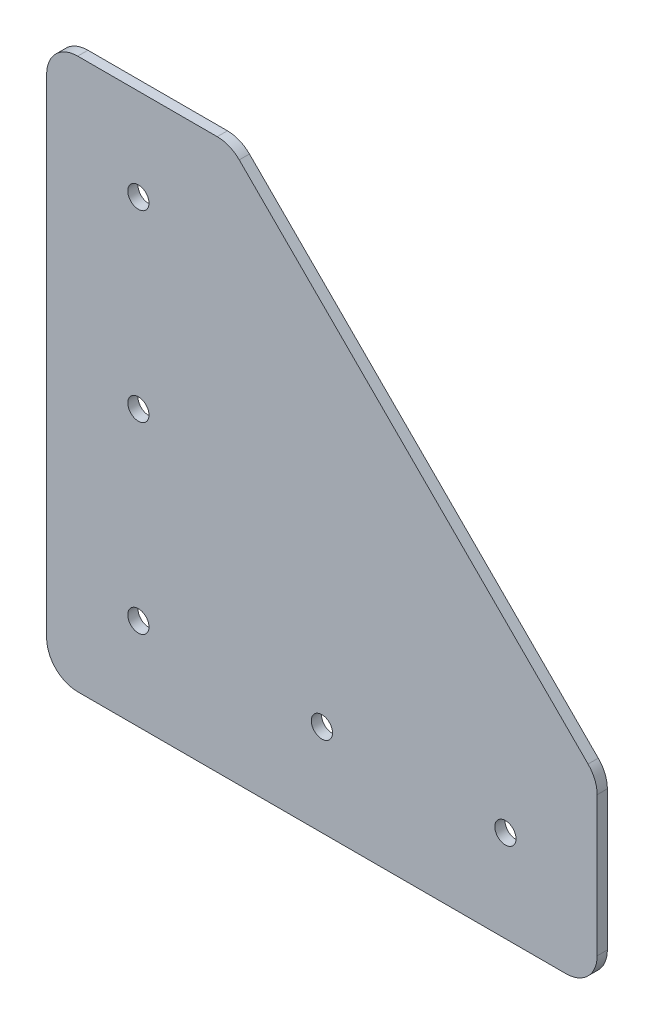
ISO-10303-21;
HEADER;
FILE_DESCRIPTION(('STEP AP214'),'2;1');
FILE_NAME('part.step','',(''),(''),'','','');
FILE_SCHEMA(('AUTOMOTIVE_DESIGN { 1 0 10303 214 1 1 1 1 }'));
ENDSEC;
DATA;
#1=APPLICATION_CONTEXT('core data for automotive mechanical design processes');
#2=APPLICATION_PROTOCOL_DEFINITION('international standard','automotive_design',2000,#1);
#3=PRODUCT_CONTEXT('',#1,'mechanical');
#4=PRODUCT('Part','Part','',(#3));
#5=PRODUCT_RELATED_PRODUCT_CATEGORY('part','',(#4));
#6=PRODUCT_DEFINITION_FORMATION('','',#4);
#7=PRODUCT_DEFINITION_CONTEXT('part definition',#1,'design');
#8=PRODUCT_DEFINITION('design','',#6,#7);
#9=PRODUCT_DEFINITION_SHAPE('','',#8);
#10=(LENGTH_UNIT() NAMED_UNIT(*) SI_UNIT(.MILLI.,.METRE.));
#11=(NAMED_UNIT(*) PLANE_ANGLE_UNIT() SI_UNIT($,.RADIAN.));
#12=(NAMED_UNIT(*) SI_UNIT($,.STERADIAN.) SOLID_ANGLE_UNIT());
#13=UNCERTAINTY_MEASURE_WITH_UNIT(LENGTH_MEASURE(1.E-05),#10,'distance_accuracy_value','');
#14=(GEOMETRIC_REPRESENTATION_CONTEXT(3) GLOBAL_UNCERTAINTY_ASSIGNED_CONTEXT((#13)) GLOBAL_UNIT_ASSIGNED_CONTEXT((#10,
#11,#12)) REPRESENTATION_CONTEXT('',''));
#15=CARTESIAN_POINT('',(0.,0.,0.));
#16=DIRECTION('',(0.,0.,1.));
#17=DIRECTION('',(1.,0.,0.));
#18=AXIS2_PLACEMENT_3D('',#15,#16,#17);
#19=CARTESIAN_POINT('',(0.,4.841875,0.));
#20=DIRECTION('',(1.,0.,0.));
#21=DIRECTION('',(0.,1.,0.));
#22=AXIS2_PLACEMENT_3D('',#19,#20,#21);
#23=PLANE('',#22);
#24=DIRECTION('',(0.,0.,-1.));
#25=VECTOR('',#24,1.);
#26=CARTESIAN_POINT('',(0.,4.84187499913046,0.79375));
#27=LINE('',#26,#25);
#28=CARTESIAN_POINT('',(0.,4.84187499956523,0.));
#29=VERTEX_POINT('',#28);
#30=CARTESIAN_POINT('',(0.,4.84187499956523,1.5875));
#31=VERTEX_POINT('',#30);
#32=EDGE_CURVE('E141',#29,#31,#27,.F.);
#33=ORIENTED_EDGE('',*,*,#32,.T.);
#34=DIRECTION('',(0.,-1.,0.));
#35=VECTOR('',#34,1.);
#36=CARTESIAN_POINT('',(0.,42.8625,1.5875));
#37=LINE('',#36,#35);
#38=CARTESIAN_POINT('',(0.,80.883125,1.5875));
#39=VERTEX_POINT('',#38);
#40=EDGE_CURVE('E171',#39,#31,#37,.T.);
#41=ORIENTED_EDGE('',*,*,#40,.F.);
#42=DIRECTION('',(0.,0.,1.));
#43=VECTOR('',#42,1.);
#44=CARTESIAN_POINT('',(0.,80.883125,0.79375));
#45=LINE('',#44,#43);
#46=CARTESIAN_POINT('',(0.,80.883125,0.));
#47=VERTEX_POINT('',#46);
#48=EDGE_CURVE('E119',#39,#47,#45,.F.);
#49=ORIENTED_EDGE('',*,*,#48,.T.);
#50=DIRECTION('',(0.,-1.,0.));
#51=VECTOR('',#50,1.);
#52=CARTESIAN_POINT('',(0.,42.8625,0.));
#53=LINE('',#52,#51);
#54=EDGE_CURVE('E188',#47,#29,#53,.T.);
#55=ORIENTED_EDGE('',*,*,#54,.T.);
#56=EDGE_LOOP('',(#33,#41,#49,#55));
#57=FACE_BOUND('',#56,.T.);
#58=ADVANCED_FACE('F16',(#57),#23,.F.);
#59=CARTESIAN_POINT('',(4.841875,4.841875,1.5875));
#60=DIRECTION('',(0.,0.,-1.));
#61=DIRECTION('',(0.,1.,0.));
#62=AXIS2_PLACEMENT_3D('',#59,#60,#61);
#63=CYLINDRICAL_SURFACE('',#62,4.841875);
#64=ORIENTED_EDGE('',*,*,#32,.F.);
#65=CARTESIAN_POINT('',(4.841875,4.841875,0.));
#66=DIRECTION('',(0.,0.,-1.));
#67=DIRECTION('',(0.,1.,0.));
#68=AXIS2_PLACEMENT_3D('',#65,#66,#67);
#69=CIRCLE('',#68,4.841875);
#70=CARTESIAN_POINT('',(4.841875,0.,0.));
#71=VERTEX_POINT('',#70);
#72=EDGE_CURVE('E185',#29,#71,#69,.F.);
#73=ORIENTED_EDGE('',*,*,#72,.T.);
#74=DIRECTION('',(0.,0.,1.));
#75=VECTOR('',#74,1.);
#76=CARTESIAN_POINT('',(4.841875,0.,0.79375));
#77=LINE('',#76,#75);
#78=CARTESIAN_POINT('',(4.841875,0.,1.5875));
#79=VERTEX_POINT('',#78);
#80=EDGE_CURVE('E138',#71,#79,#77,.T.);
#81=ORIENTED_EDGE('',*,*,#80,.T.);
#82=CARTESIAN_POINT('',(4.841875,4.841875,1.5875));
#83=DIRECTION('',(0.,0.,-1.));
#84=DIRECTION('',(0.,1.,0.));
#85=AXIS2_PLACEMENT_3D('',#82,#83,#84);
#86=CIRCLE('',#85,4.841875);
#87=EDGE_CURVE('E169',#31,#79,#86,.F.);
#88=ORIENTED_EDGE('',*,*,#87,.F.);
#89=EDGE_LOOP('',(#64,#73,#81,#88));
#90=FACE_BOUND('',#89,.T.);
#91=ADVANCED_FACE('F263',(#90),#63,.T.);
#92=CARTESIAN_POINT('',(80.883125,0.,0.));
#93=DIRECTION('',(0.,1.,0.));
#94=DIRECTION('',(-1.,0.,0.));
#95=AXIS2_PLACEMENT_3D('',#92,#93,#94);
#96=PLANE('',#95);
#97=ORIENTED_EDGE('',*,*,#80,.F.);
#98=DIRECTION('',(1.,0.,0.));
#99=VECTOR('',#98,1.);
#100=CARTESIAN_POINT('',(42.8625,0.,0.));
#101=LINE('',#100,#99);
#102=CARTESIAN_POINT('',(80.8831250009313,0.,0.));
#103=VERTEX_POINT('',#102);
#104=EDGE_CURVE('E184',#71,#103,#101,.T.);
#105=ORIENTED_EDGE('',*,*,#104,.T.);
#106=DIRECTION('',(0.,0.,-1.));
#107=VECTOR('',#106,1.);
#108=CARTESIAN_POINT('',(80.8831250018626,0.,0.79375));
#109=LINE('',#108,#107);
#110=CARTESIAN_POINT('',(80.8831250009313,0.,1.5875));
#111=VERTEX_POINT('',#110);
#112=EDGE_CURVE('E92',#103,#111,#109,.F.);
#113=ORIENTED_EDGE('',*,*,#112,.T.);
#114=DIRECTION('',(1.,0.,0.));
#115=VECTOR('',#114,1.);
#116=CARTESIAN_POINT('',(42.8625,0.,1.5875));
#117=LINE('',#116,#115);
#118=EDGE_CURVE('E168',#79,#111,#117,.T.);
#119=ORIENTED_EDGE('',*,*,#118,.F.);
#120=EDGE_LOOP('',(#97,#105,#113,#119));
#121=FACE_BOUND('',#120,.T.);
#122=ADVANCED_FACE('F262',(#121),#96,.F.);
#123=CARTESIAN_POINT('',(80.883125,4.841875,1.5875));
#124=DIRECTION('',(0.,0.,-1.));
#125=DIRECTION('',(0.,1.,0.));
#126=AXIS2_PLACEMENT_3D('',#123,#124,#125);
#127=CYLINDRICAL_SURFACE('',#126,4.84187500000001);
#128=ORIENTED_EDGE('',*,*,#112,.F.);
#129=CARTESIAN_POINT('',(80.883125,4.841875,0.));
#130=DIRECTION('',(0.,0.,-1.));
#131=DIRECTION('',(0.,1.,0.));
#132=AXIS2_PLACEMENT_3D('',#129,#130,#131);
#133=CIRCLE('',#132,4.84187500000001);
#134=CARTESIAN_POINT('',(85.725,4.841875,0.));
#135=VERTEX_POINT('',#134);
#136=EDGE_CURVE('E20',#103,#135,#133,.F.);
#137=ORIENTED_EDGE('',*,*,#136,.T.);
#138=DIRECTION('',(0.,0.,1.));
#139=VECTOR('',#138,1.);
#140=CARTESIAN_POINT('',(85.725,4.841875,0.79375));
#141=LINE('',#140,#139);
#142=CARTESIAN_POINT('',(85.725,4.841875,1.5875));
#143=VERTEX_POINT('',#142);
#144=EDGE_CURVE('E99',#135,#143,#141,.T.);
#145=ORIENTED_EDGE('',*,*,#144,.T.);
#146=CARTESIAN_POINT('',(80.883125,4.841875,1.5875));
#147=DIRECTION('',(0.,0.,-1.));
#148=DIRECTION('',(0.,1.,0.));
#149=AXIS2_PLACEMENT_3D('',#146,#147,#148);
#150=CIRCLE('',#149,4.84187500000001);
#151=EDGE_CURVE('E166',#111,#143,#150,.F.);
#152=ORIENTED_EDGE('',*,*,#151,.F.);
#153=EDGE_LOOP('',(#128,#137,#145,#152));
#154=FACE_BOUND('',#153,.T.);
#155=ADVANCED_FACE('F117',(#154),#127,.T.);
#156=CARTESIAN_POINT('',(85.725,4.841875,0.));
#157=DIRECTION('',(-1.,0.,0.));
#158=DIRECTION('',(0.,0.,1.));
#159=AXIS2_PLACEMENT_3D('',#156,#157,#158);
#160=PLANE('',#159);
#161=ORIENTED_EDGE('',*,*,#144,.F.);
#162=DIRECTION('',(0.,1.,0.));
#163=VECTOR('',#162,1.);
#164=CARTESIAN_POINT('',(85.725,42.8625,0.));
#165=LINE('',#164,#163);
#166=CARTESIAN_POINT('',(85.725,26.5694297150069,0.));
#167=VERTEX_POINT('',#166);
#168=EDGE_CURVE('E103',#135,#167,#165,.T.);
#169=ORIENTED_EDGE('',*,*,#168,.T.);
#170=DIRECTION('',(0.,0.,-1.));
#171=VECTOR('',#170,1.);
#172=CARTESIAN_POINT('',(85.725,26.5694297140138,0.79375));
#173=LINE('',#172,#171);
#174=CARTESIAN_POINT('',(85.725,26.5694297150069,1.5875));
#175=VERTEX_POINT('',#174);
#176=EDGE_CURVE('E105',#167,#175,#173,.F.);
#177=ORIENTED_EDGE('',*,*,#176,.T.);
#178=DIRECTION('',(0.,1.,0.));
#179=VECTOR('',#178,1.);
#180=CARTESIAN_POINT('',(85.725,42.8625,1.5875));
#181=LINE('',#180,#179);
#182=EDGE_CURVE('E104',#143,#175,#181,.T.);
#183=ORIENTED_EDGE('',*,*,#182,.F.);
#184=EDGE_LOOP('',(#161,#169,#177,#183));
#185=FACE_BOUND('',#184,.T.);
#186=ADVANCED_FACE('F101',(#185),#160,.F.);
#187=CARTESIAN_POINT('',(80.883125,26.569429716,1.5875));
#188=DIRECTION('',(0.,0.,-1.));
#189=DIRECTION('',(0.,1.,0.));
#190=AXIS2_PLACEMENT_3D('',#187,#188,#189);
#191=CYLINDRICAL_SURFACE('',#190,4.84187500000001);
#192=ORIENTED_EDGE('',*,*,#176,.F.);
#193=CARTESIAN_POINT('',(80.883125,26.569429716,0.));
#194=DIRECTION('',(0.,0.,-1.));
#195=DIRECTION('',(0.,1.,0.));
#196=AXIS2_PLACEMENT_3D('',#193,#194,#195);
#197=CIRCLE('',#196,4.84187500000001);
#198=CARTESIAN_POINT('',(84.306847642,29.993152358,0.));
#199=VERTEX_POINT('',#198);
#200=EDGE_CURVE('E115',#167,#199,#197,.F.);
#201=ORIENTED_EDGE('',*,*,#200,.T.);
#202=DIRECTION('',(0.,0.,1.));
#203=VECTOR('',#202,1.);
#204=CARTESIAN_POINT('',(84.306847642,29.993152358,0.79375));
#205=LINE('',#204,#203);
#206=CARTESIAN_POINT('',(84.3068476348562,29.9931523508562,1.5875));
#207=VERTEX_POINT('',#206);
#208=EDGE_CURVE('E133',#199,#207,#205,.T.);
#209=ORIENTED_EDGE('',*,*,#208,.T.);
#210=CARTESIAN_POINT('',(80.883125,26.569429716,1.5875));
#211=DIRECTION('',(0.,0.,-1.));
#212=DIRECTION('',(0.,1.,0.));
#213=AXIS2_PLACEMENT_3D('',#210,#211,#212);
#214=CIRCLE('',#213,4.84187500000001);
#215=EDGE_CURVE('E164',#175,#207,#214,.F.);
#216=ORIENTED_EDGE('',*,*,#215,.F.);
#217=EDGE_LOOP('',(#192,#201,#209,#216));
#218=FACE_BOUND('',#217,.T.);
#219=ADVANCED_FACE('F199',(#218),#191,.T.);
#220=CARTESIAN_POINT('',(29.993152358,84.306847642,0.));
#221=DIRECTION('',(-0.707106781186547,-0.707106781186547,0.));
#222=DIRECTION('',(0.707106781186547,-0.707106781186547,0.));
#223=AXIS2_PLACEMENT_3D('',#220,#221,#222);
#224=PLANE('',#223);
#225=ORIENTED_EDGE('',*,*,#208,.F.);
#226=DIRECTION('',(0.707106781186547,-0.707106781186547,0.));
#227=VECTOR('',#226,1.);
#228=CARTESIAN_POINT('',(29.993152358,84.306847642,0.));
#229=LINE('',#228,#227);
#230=CARTESIAN_POINT('',(29.9931523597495,84.3068476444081,0.));
#231=VERTEX_POINT('',#230);
#232=EDGE_CURVE('E196',#199,#231,#229,.F.);
#233=ORIENTED_EDGE('',*,*,#232,.T.);
#234=DIRECTION('',(0.,0.,-1.));
#235=VECTOR('',#234,1.);
#236=CARTESIAN_POINT('',(29.9931523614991,84.3068476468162,0.79375));
#237=LINE('',#236,#235);
#238=CARTESIAN_POINT('',(29.9931523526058,84.3068476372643,1.5875));
#239=VERTEX_POINT('',#238);
#240=EDGE_CURVE('E130',#231,#239,#237,.F.);
#241=ORIENTED_EDGE('',*,*,#240,.T.);
#242=DIRECTION('',(-0.707106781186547,0.707106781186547,0.));
#243=VECTOR('',#242,1.);
#244=CARTESIAN_POINT('',(84.306847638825,29.9931523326,1.5875));
#245=LINE('',#244,#243);
#246=EDGE_CURVE('E162',#207,#239,#245,.T.);
#247=ORIENTED_EDGE('',*,*,#246,.F.);
#248=EDGE_LOOP('',(#225,#233,#241,#247));
#249=FACE_BOUND('',#248,.T.);
#250=ADVANCED_FACE('F218',(#249),#224,.F.);
#251=CARTESIAN_POINT('',(26.569429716,80.883125,1.5875));
#252=DIRECTION('',(0.,0.,-1.));
#253=DIRECTION('',(0.,1.,0.));
#254=AXIS2_PLACEMENT_3D('',#251,#252,#253);
#255=CYLINDRICAL_SURFACE('',#254,4.84187500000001);
#256=ORIENTED_EDGE('',*,*,#240,.F.);
#257=CARTESIAN_POINT('',(26.569429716,80.883125,0.));
#258=DIRECTION('',(0.,0.,-1.));
#259=DIRECTION('',(0.,1.,0.));
#260=AXIS2_PLACEMENT_3D('',#257,#258,#259);
#261=CIRCLE('',#260,4.84187500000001);
#262=CARTESIAN_POINT('',(26.569429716,85.725,0.));
#263=VERTEX_POINT('',#262);
#264=EDGE_CURVE('E193',#231,#263,#261,.F.);
#265=ORIENTED_EDGE('',*,*,#264,.T.);
#266=DIRECTION('',(0.,0.,1.));
#267=VECTOR('',#266,1.);
#268=CARTESIAN_POINT('',(26.569429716,85.725,0.79375));
#269=LINE('',#268,#267);
#270=CARTESIAN_POINT('',(26.569429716,85.725,1.5875));
#271=VERTEX_POINT('',#270);
#272=EDGE_CURVE('E124',#263,#271,#269,.T.);
#273=ORIENTED_EDGE('',*,*,#272,.T.);
#274=CARTESIAN_POINT('',(26.569429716,80.883125,1.5875));
#275=DIRECTION('',(0.,0.,-1.));
#276=DIRECTION('',(0.,1.,0.));
#277=AXIS2_PLACEMENT_3D('',#274,#275,#276);
#278=CIRCLE('',#277,4.84187500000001);
#279=EDGE_CURVE('E160',#239,#271,#278,.F.);
#280=ORIENTED_EDGE('',*,*,#279,.F.);
#281=EDGE_LOOP('',(#256,#265,#273,#280));
#282=FACE_BOUND('',#281,.T.);
#283=ADVANCED_FACE('F215',(#282),#255,.T.);
#284=CARTESIAN_POINT('',(4.841875,85.725,0.));
#285=DIRECTION('',(0.,-1.,0.));
#286=DIRECTION('',(1.,0.,0.));
#287=AXIS2_PLACEMENT_3D('',#284,#285,#286);
#288=PLANE('',#287);
#289=ORIENTED_EDGE('',*,*,#272,.F.);
#290=DIRECTION('',(-1.,0.,0.));
#291=VECTOR('',#290,1.);
#292=CARTESIAN_POINT('',(42.8625,85.725,0.));
#293=LINE('',#292,#291);
#294=CARTESIAN_POINT('',(4.84187500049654,85.725,0.));
#295=VERTEX_POINT('',#294);
#296=EDGE_CURVE('E192',#263,#295,#293,.T.);
#297=ORIENTED_EDGE('',*,*,#296,.T.);
#298=DIRECTION('',(0.,0.,-1.));
#299=VECTOR('',#298,1.);
#300=CARTESIAN_POINT('',(4.84187500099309,85.725,0.79375));
#301=LINE('',#300,#299);
#302=CARTESIAN_POINT('',(4.84187500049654,85.725,1.5875));
#303=VERTEX_POINT('',#302);
#304=EDGE_CURVE('E118',#295,#303,#301,.F.);
#305=ORIENTED_EDGE('',*,*,#304,.T.);
#306=DIRECTION('',(-1.,0.,0.));
#307=VECTOR('',#306,1.);
#308=CARTESIAN_POINT('',(42.8625,85.725,1.5875));
#309=LINE('',#308,#307);
#310=EDGE_CURVE('E35',#271,#303,#309,.T.);
#311=ORIENTED_EDGE('',*,*,#310,.F.);
#312=EDGE_LOOP('',(#289,#297,#305,#311));
#313=FACE_BOUND('',#312,.T.);
#314=ADVANCED_FACE('F210',(#313),#288,.F.);
#315=CARTESIAN_POINT('',(4.841875,80.883125,1.5875));
#316=DIRECTION('',(0.,0.,-1.));
#317=DIRECTION('',(0.,1.,0.));
#318=AXIS2_PLACEMENT_3D('',#315,#316,#317);
#319=CYLINDRICAL_SURFACE('',#318,4.841875);
#320=ORIENTED_EDGE('',*,*,#304,.F.);
#321=CARTESIAN_POINT('',(4.841875,80.883125,0.));
#322=DIRECTION('',(0.,0.,-1.));
#323=DIRECTION('',(0.,1.,0.));
#324=AXIS2_PLACEMENT_3D('',#321,#322,#323);
#325=CIRCLE('',#324,4.841875);
#326=EDGE_CURVE('E189',#295,#47,#325,.F.);
#327=ORIENTED_EDGE('',*,*,#326,.T.);
#328=ORIENTED_EDGE('',*,*,#48,.F.);
#329=CARTESIAN_POINT('',(4.841875,80.883125,1.5875));
#330=DIRECTION('',(0.,0.,-1.));
#331=DIRECTION('',(0.,1.,0.));
#332=AXIS2_PLACEMENT_3D('',#329,#330,#331);
#333=CIRCLE('',#332,4.841875);
#334=EDGE_CURVE('E158',#303,#39,#333,.F.);
#335=ORIENTED_EDGE('',*,*,#334,.F.);
#336=EDGE_LOOP('',(#320,#327,#328,#335));
#337=FACE_BOUND('',#336,.T.);
#338=ADVANCED_FACE('F255',(#337),#319,.T.);
#339=CARTESIAN_POINT('',(42.8625,14.2875,0.));
#340=DIRECTION('',(0.,0.,1.));
#341=DIRECTION('',(1.,0.,0.));
#342=AXIS2_PLACEMENT_3D('',#339,#340,#341);
#343=CYLINDRICAL_SURFACE('',#342,1.65100000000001);
#344=CARTESIAN_POINT('',(42.8625,14.2875,1.5875));
#345=DIRECTION('',(0.,0.,1.));
#346=DIRECTION('',(1.,0.,0.));
#347=AXIS2_PLACEMENT_3D('',#344,#345,#346);
#348=CIRCLE('',#347,1.65100000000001);
#349=CARTESIAN_POINT('',(44.5135,14.2875,1.5875));
#350=VERTEX_POINT('',#349);
#351=EDGE_CURVE('E155',#350,#350,#348,.F.);
#352=ORIENTED_EDGE('',*,*,#351,.F.);
#353=EDGE_LOOP('',(#352));
#354=FACE_BOUND('',#353,.T.);
#355=CARTESIAN_POINT('',(42.8625,14.2875,0.));
#356=DIRECTION('',(0.,0.,1.));
#357=DIRECTION('',(1.,0.,0.));
#358=AXIS2_PLACEMENT_3D('',#355,#356,#357);
#359=CIRCLE('',#358,1.65100000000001);
#360=CARTESIAN_POINT('',(44.5135,14.2875,0.));
#361=VERTEX_POINT('',#360);
#362=EDGE_CURVE('E181',#361,#361,#359,.F.);
#363=ORIENTED_EDGE('',*,*,#362,.T.);
#364=EDGE_LOOP('',(#363));
#365=FACE_BOUND('',#364,.T.);
#366=ADVANCED_FACE('F251',(#354,#365),#343,.F.);
#367=CARTESIAN_POINT('',(14.2875,14.2875,0.));
#368=DIRECTION('',(0.,0.,1.));
#369=DIRECTION('',(1.,0.,0.));
#370=AXIS2_PLACEMENT_3D('',#367,#368,#369);
#371=CYLINDRICAL_SURFACE('',#370,1.651);
#372=CARTESIAN_POINT('',(14.2875,14.2875,1.5875));
#373=DIRECTION('',(0.,0.,1.));
#374=DIRECTION('',(1.,0.,0.));
#375=AXIS2_PLACEMENT_3D('',#372,#373,#374);
#376=CIRCLE('',#375,1.651);
#377=CARTESIAN_POINT('',(15.9385,14.2875,1.5875));
#378=VERTEX_POINT('',#377);
#379=EDGE_CURVE('E152',#378,#378,#376,.F.);
#380=ORIENTED_EDGE('',*,*,#379,.F.);
#381=EDGE_LOOP('',(#380));
#382=FACE_BOUND('',#381,.T.);
#383=CARTESIAN_POINT('',(14.2875,14.2875,0.));
#384=DIRECTION('',(0.,0.,1.));
#385=DIRECTION('',(1.,0.,0.));
#386=AXIS2_PLACEMENT_3D('',#383,#384,#385);
#387=CIRCLE('',#386,1.651);
#388=CARTESIAN_POINT('',(15.9385,14.2875,0.));
#389=VERTEX_POINT('',#388);
#390=EDGE_CURVE('E178',#389,#389,#387,.F.);
#391=ORIENTED_EDGE('',*,*,#390,.T.);
#392=EDGE_LOOP('',(#391));
#393=FACE_BOUND('',#392,.T.);
#394=ADVANCED_FACE('F247',(#382,#393),#371,.F.);
#395=CARTESIAN_POINT('',(14.2875,42.8625,0.));
#396=DIRECTION('',(0.,0.,1.));
#397=DIRECTION('',(1.,0.,0.));
#398=AXIS2_PLACEMENT_3D('',#395,#396,#397);
#399=CYLINDRICAL_SURFACE('',#398,1.651);
#400=CARTESIAN_POINT('',(14.2875,42.8625,1.5875));
#401=DIRECTION('',(0.,0.,1.));
#402=DIRECTION('',(1.,0.,0.));
#403=AXIS2_PLACEMENT_3D('',#400,#401,#402);
#404=CIRCLE('',#403,1.651);
#405=CARTESIAN_POINT('',(15.9385,42.8625,1.5875));
#406=VERTEX_POINT('',#405);
#407=EDGE_CURVE('E149',#406,#406,#404,.F.);
#408=ORIENTED_EDGE('',*,*,#407,.F.);
#409=EDGE_LOOP('',(#408));
#410=FACE_BOUND('',#409,.T.);
#411=CARTESIAN_POINT('',(14.2875,42.8625,0.));
#412=DIRECTION('',(0.,0.,1.));
#413=DIRECTION('',(1.,0.,0.));
#414=AXIS2_PLACEMENT_3D('',#411,#412,#413);
#415=CIRCLE('',#414,1.651);
#416=CARTESIAN_POINT('',(15.9385,42.8625,0.));
#417=VERTEX_POINT('',#416);
#418=EDGE_CURVE('E175',#417,#417,#415,.F.);
#419=ORIENTED_EDGE('',*,*,#418,.T.);
#420=EDGE_LOOP('',(#419));
#421=FACE_BOUND('',#420,.T.);
#422=ADVANCED_FACE('F243',(#410,#421),#399,.F.);
#423=CARTESIAN_POINT('',(14.2875,71.4375,0.));
#424=DIRECTION('',(0.,0.,1.));
#425=DIRECTION('',(1.,0.,0.));
#426=AXIS2_PLACEMENT_3D('',#423,#424,#425);
#427=CYLINDRICAL_SURFACE('',#426,1.651);
#428=CARTESIAN_POINT('',(14.2875,71.4375,1.5875));
#429=DIRECTION('',(0.,0.,1.));
#430=DIRECTION('',(1.,0.,0.));
#431=AXIS2_PLACEMENT_3D('',#428,#429,#430);
#432=CIRCLE('',#431,1.651);
#433=CARTESIAN_POINT('',(15.9385,71.4375,1.5875));
#434=VERTEX_POINT('',#433);
#435=EDGE_CURVE('E146',#434,#434,#432,.F.);
#436=ORIENTED_EDGE('',*,*,#435,.F.);
#437=EDGE_LOOP('',(#436));
#438=FACE_BOUND('',#437,.T.);
#439=CARTESIAN_POINT('',(14.2875,71.4375,0.));
#440=DIRECTION('',(0.,0.,1.));
#441=DIRECTION('',(1.,0.,0.));
#442=AXIS2_PLACEMENT_3D('',#439,#440,#441);
#443=CIRCLE('',#442,1.651);
#444=CARTESIAN_POINT('',(15.9385,71.4375,0.));
#445=VERTEX_POINT('',#444);
#446=EDGE_CURVE('E172',#445,#445,#443,.F.);
#447=ORIENTED_EDGE('',*,*,#446,.T.);
#448=EDGE_LOOP('',(#447));
#449=FACE_BOUND('',#448,.T.);
#450=ADVANCED_FACE('F240',(#438,#449),#427,.F.);
#451=CARTESIAN_POINT('',(0.,0.,0.));
#452=DIRECTION('',(0.,0.,1.));
#453=DIRECTION('',(1.,0.,0.));
#454=AXIS2_PLACEMENT_3D('',#451,#452,#453);
#455=PLANE('',#454);
#456=ORIENTED_EDGE('',*,*,#446,.F.);
#457=EDGE_LOOP('',(#456));
#458=FACE_BOUND('',#457,.T.);
#459=ORIENTED_EDGE('',*,*,#418,.F.);
#460=EDGE_LOOP('',(#459));
#461=FACE_BOUND('',#460,.T.);
#462=ORIENTED_EDGE('',*,*,#390,.F.);
#463=EDGE_LOOP('',(#462));
#464=FACE_BOUND('',#463,.T.);
#465=ORIENTED_EDGE('',*,*,#362,.F.);
#466=EDGE_LOOP('',(#465));
#467=FACE_BOUND('',#466,.T.);
#468=CARTESIAN_POINT('',(71.4375,14.2875,0.));
#469=DIRECTION('',(0.,0.,1.));
#470=DIRECTION('',(1.,0.,0.));
#471=AXIS2_PLACEMENT_3D('',#468,#469,#470);
#472=CIRCLE('',#471,1.651);
#473=CARTESIAN_POINT('',(73.0885,14.2875,0.));
#474=VERTEX_POINT('',#473);
#475=EDGE_CURVE('E26',#474,#474,#472,.F.);
#476=ORIENTED_EDGE('',*,*,#475,.F.);
#477=EDGE_LOOP('',(#476));
#478=FACE_BOUND('',#477,.T.);
#479=ORIENTED_EDGE('',*,*,#72,.F.);
#480=ORIENTED_EDGE('',*,*,#54,.F.);
#481=ORIENTED_EDGE('',*,*,#326,.F.);
#482=ORIENTED_EDGE('',*,*,#296,.F.);
#483=ORIENTED_EDGE('',*,*,#264,.F.);
#484=ORIENTED_EDGE('',*,*,#232,.F.);
#485=ORIENTED_EDGE('',*,*,#200,.F.);
#486=ORIENTED_EDGE('',*,*,#168,.F.);
#487=ORIENTED_EDGE('',*,*,#136,.F.);
#488=ORIENTED_EDGE('',*,*,#104,.F.);
#489=EDGE_LOOP('',(#479,#480,#481,#482,#483,#484,#485,#486,#487,#488));
#490=FACE_BOUND('',#489,.T.);
#491=ADVANCED_FACE('F110',(#458,#461,#464,#467,#478,#490),#455,.F.);
#492=CARTESIAN_POINT('',(0.,0.,1.5875));
#493=DIRECTION('',(0.,0.,1.));
#494=DIRECTION('',(1.,0.,0.));
#495=AXIS2_PLACEMENT_3D('',#492,#493,#494);
#496=PLANE('',#495);
#497=ORIENTED_EDGE('',*,*,#435,.T.);
#498=EDGE_LOOP('',(#497));
#499=FACE_BOUND('',#498,.T.);
#500=ORIENTED_EDGE('',*,*,#407,.T.);
#501=EDGE_LOOP('',(#500));
#502=FACE_BOUND('',#501,.T.);
#503=ORIENTED_EDGE('',*,*,#379,.T.);
#504=EDGE_LOOP('',(#503));
#505=FACE_BOUND('',#504,.T.);
#506=ORIENTED_EDGE('',*,*,#351,.T.);
#507=EDGE_LOOP('',(#506));
#508=FACE_BOUND('',#507,.T.);
#509=CARTESIAN_POINT('',(71.4375,14.2875,1.5875));
#510=DIRECTION('',(0.,0.,1.));
#511=DIRECTION('',(1.,0.,0.));
#512=AXIS2_PLACEMENT_3D('',#509,#510,#511);
#513=CIRCLE('',#512,1.651);
#514=CARTESIAN_POINT('',(73.0885,14.2875,1.5875));
#515=VERTEX_POINT('',#514);
#516=EDGE_CURVE('E10',#515,#515,#513,.T.);
#517=ORIENTED_EDGE('',*,*,#516,.F.);
#518=EDGE_LOOP('',(#517));
#519=FACE_BOUND('',#518,.T.);
#520=ORIENTED_EDGE('',*,*,#310,.T.);
#521=ORIENTED_EDGE('',*,*,#334,.T.);
#522=ORIENTED_EDGE('',*,*,#40,.T.);
#523=ORIENTED_EDGE('',*,*,#87,.T.);
#524=ORIENTED_EDGE('',*,*,#118,.T.);
#525=ORIENTED_EDGE('',*,*,#151,.T.);
#526=ORIENTED_EDGE('',*,*,#182,.T.);
#527=ORIENTED_EDGE('',*,*,#215,.T.);
#528=ORIENTED_EDGE('',*,*,#246,.T.);
#529=ORIENTED_EDGE('',*,*,#279,.T.);
#530=EDGE_LOOP('',(#520,#521,#522,#523,#524,#525,#526,#527,#528,#529));
#531=FACE_BOUND('',#530,.T.);
#532=ADVANCED_FACE('F18',(#499,#502,#505,#508,#519,#531),#496,.T.);
#533=CARTESIAN_POINT('',(71.4375,14.2875,0.));
#534=DIRECTION('',(0.,0.,1.));
#535=DIRECTION('',(1.,0.,0.));
#536=AXIS2_PLACEMENT_3D('',#533,#534,#535);
#537=CYLINDRICAL_SURFACE('',#536,1.651);
#538=ORIENTED_EDGE('',*,*,#475,.T.);
#539=EDGE_LOOP('',(#538));
#540=FACE_BOUND('',#539,.T.);
#541=ORIENTED_EDGE('',*,*,#516,.T.);
#542=EDGE_LOOP('',(#541));
#543=FACE_BOUND('',#542,.T.);
#544=ADVANCED_FACE('F230',(#540,#543),#537,.F.);
#545=CLOSED_SHELL('',(#58,#91,#122,#155,#186,#219,#250,#283,#314,#338,#366,#394,#422,#450,#491,
#532,#544));
#546=MANIFOLD_SOLID_BREP('B1',#545);
#547=ADVANCED_BREP_SHAPE_REPRESENTATION('',(#18,#546),#14);
#548=SHAPE_DEFINITION_REPRESENTATION(#9,#547);
ENDSEC;
END-ISO-10303-21;
